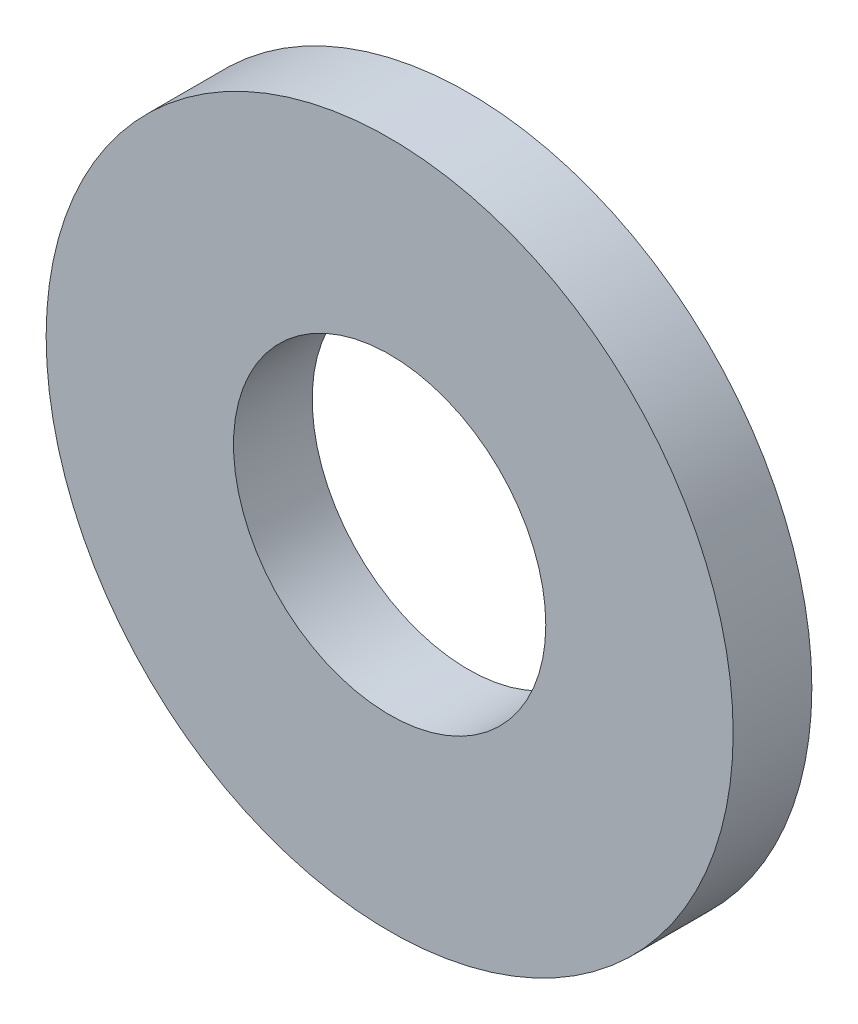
ISO-10303-21;
HEADER;
FILE_DESCRIPTION(('STEP AP214'),'2;1');
FILE_NAME('part.step','',(''),(''),'','','');
FILE_SCHEMA(('AUTOMOTIVE_DESIGN { 1 0 10303 214 1 1 1 1 }'));
ENDSEC;
DATA;
#1=APPLICATION_CONTEXT('core data for automotive mechanical design processes');
#2=APPLICATION_PROTOCOL_DEFINITION('international standard','automotive_design',2000,#1);
#3=PRODUCT_CONTEXT('',#1,'mechanical');
#4=PRODUCT('Part','Part','',(#3));
#5=PRODUCT_RELATED_PRODUCT_CATEGORY('part','',(#4));
#6=PRODUCT_DEFINITION_FORMATION('','',#4);
#7=PRODUCT_DEFINITION_CONTEXT('part definition',#1,'design');
#8=PRODUCT_DEFINITION('design','',#6,#7);
#9=PRODUCT_DEFINITION_SHAPE('','',#8);
#10=(LENGTH_UNIT() NAMED_UNIT(*) SI_UNIT(.MILLI.,.METRE.));
#11=(NAMED_UNIT(*) PLANE_ANGLE_UNIT() SI_UNIT($,.RADIAN.));
#12=(NAMED_UNIT(*) SI_UNIT($,.STERADIAN.) SOLID_ANGLE_UNIT());
#13=UNCERTAINTY_MEASURE_WITH_UNIT(LENGTH_MEASURE(1.E-05),#10,'distance_accuracy_value','');
#14=(GEOMETRIC_REPRESENTATION_CONTEXT(3) GLOBAL_UNCERTAINTY_ASSIGNED_CONTEXT((#13)) GLOBAL_UNIT_ASSIGNED_CONTEXT((#10,
#11,#12)) REPRESENTATION_CONTEXT('',''));
#15=CARTESIAN_POINT('',(0.,0.,0.));
#16=DIRECTION('',(0.,0.,1.));
#17=DIRECTION('',(1.,0.,0.));
#18=AXIS2_PLACEMENT_3D('',#15,#16,#17);
#19=CARTESIAN_POINT('',(0.,0.,1.6002));
#20=DIRECTION('',(0.,0.,-1.));
#21=DIRECTION('',(-1.,0.,0.));
#22=AXIS2_PLACEMENT_3D('',#19,#20,#21);
#23=CYLINDRICAL_SURFACE('',#22,6.985);
#24=CARTESIAN_POINT('',(0.,0.,1.6002));
#25=DIRECTION('',(0.,0.,1.));
#26=DIRECTION('',(1.,0.,0.));
#27=AXIS2_PLACEMENT_3D('',#24,#25,#26);
#28=CIRCLE('',#27,6.985);
#29=CARTESIAN_POINT('',(6.985,0.,1.6002));
#30=VERTEX_POINT('',#29);
#31=EDGE_CURVE('E10',#30,#30,#28,.T.);
#32=ORIENTED_EDGE('',*,*,#31,.F.);
#33=EDGE_LOOP('',(#32));
#34=FACE_BOUND('',#33,.T.);
#35=CARTESIAN_POINT('',(0.,0.,0.));
#36=DIRECTION('',(0.,0.,1.));
#37=DIRECTION('',(1.,0.,0.));
#38=AXIS2_PLACEMENT_3D('',#35,#36,#37);
#39=CIRCLE('',#38,6.985);
#40=CARTESIAN_POINT('',(6.985,0.,0.));
#41=VERTEX_POINT('',#40);
#42=EDGE_CURVE('E32',#41,#41,#39,.T.);
#43=ORIENTED_EDGE('',*,*,#42,.T.);
#44=EDGE_LOOP('',(#43));
#45=FACE_BOUND('',#44,.T.);
#46=ADVANCED_FACE('F26',(#34,#45),#23,.T.);
#47=CARTESIAN_POINT('',(0.,0.,1.6002));
#48=DIRECTION('',(0.,0.,1.));
#49=DIRECTION('',(1.,0.,0.));
#50=AXIS2_PLACEMENT_3D('',#47,#48,#49);
#51=PLANE('',#50);
#52=CARTESIAN_POINT('',(0.,0.,1.6002));
#53=DIRECTION('',(0.,0.,1.));
#54=DIRECTION('',(1.,0.,0.));
#55=AXIS2_PLACEMENT_3D('',#52,#53,#54);
#56=CIRCLE('',#55,3.175);
#57=CARTESIAN_POINT('',(3.175,0.,1.6002));
#58=VERTEX_POINT('',#57);
#59=EDGE_CURVE('E40',#58,#58,#56,.T.);
#60=ORIENTED_EDGE('',*,*,#59,.F.);
#61=EDGE_LOOP('',(#60));
#62=FACE_BOUND('',#61,.T.);
#63=ORIENTED_EDGE('',*,*,#31,.T.);
#64=EDGE_LOOP('',(#63));
#65=FACE_BOUND('',#64,.T.);
#66=ADVANCED_FACE('F48',(#62,#65),#51,.T.);
#67=CARTESIAN_POINT('',(0.,0.,0.));
#68=DIRECTION('',(0.,0.,1.));
#69=DIRECTION('',(1.,0.,0.));
#70=AXIS2_PLACEMENT_3D('',#67,#68,#69);
#71=PLANE('',#70);
#72=CARTESIAN_POINT('',(0.,0.,0.));
#73=DIRECTION('',(0.,0.,1.));
#74=DIRECTION('',(1.,0.,0.));
#75=AXIS2_PLACEMENT_3D('',#72,#73,#74);
#76=CIRCLE('',#75,3.175);
#77=CARTESIAN_POINT('',(3.175,0.,0.));
#78=VERTEX_POINT('',#77);
#79=EDGE_CURVE('E36',#78,#78,#76,.T.);
#80=ORIENTED_EDGE('',*,*,#79,.T.);
#81=EDGE_LOOP('',(#80));
#82=FACE_BOUND('',#81,.T.);
#83=ORIENTED_EDGE('',*,*,#42,.F.);
#84=EDGE_LOOP('',(#83));
#85=FACE_BOUND('',#84,.T.);
#86=ADVANCED_FACE('F50',(#82,#85),#71,.F.);
#87=CARTESIAN_POINT('',(0.,0.,0.));
#88=DIRECTION('',(0.,0.,1.));
#89=DIRECTION('',(1.,0.,0.));
#90=AXIS2_PLACEMENT_3D('',#87,#88,#89);
#91=CYLINDRICAL_SURFACE('',#90,3.175);
#92=ORIENTED_EDGE('',*,*,#79,.F.);
#93=EDGE_LOOP('',(#92));
#94=FACE_BOUND('',#93,.T.);
#95=ORIENTED_EDGE('',*,*,#59,.T.);
#96=EDGE_LOOP('',(#95));
#97=FACE_BOUND('',#96,.T.);
#98=ADVANCED_FACE('F46',(#94,#97),#91,.F.);
#99=CLOSED_SHELL('',(#46,#66,#86,#98));
#100=MANIFOLD_SOLID_BREP('B2',#99);
#101=ADVANCED_BREP_SHAPE_REPRESENTATION('',(#18,#100),#14);
#102=SHAPE_DEFINITION_REPRESENTATION(#9,#101);
ENDSEC;
END-ISO-10303-21;
